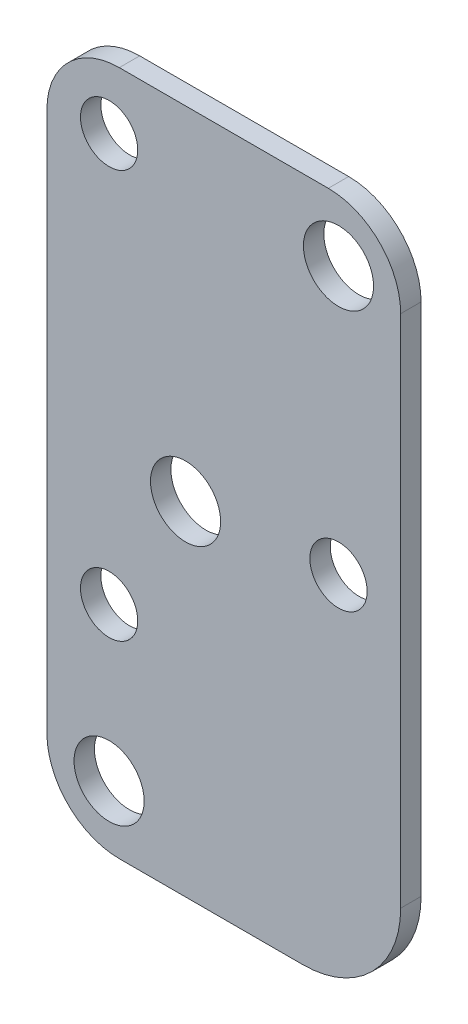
ISO-10303-21;
HEADER;
FILE_DESCRIPTION(('STEP AP214'),'2;1');
FILE_NAME('part.step','',(''),(''),'','','');
FILE_SCHEMA(('AUTOMOTIVE_DESIGN { 1 0 10303 214 1 1 1 1 }'));
ENDSEC;
DATA;
#1=APPLICATION_CONTEXT('core data for automotive mechanical design processes');
#2=APPLICATION_PROTOCOL_DEFINITION('international standard','automotive_design',2000,#1);
#3=PRODUCT_CONTEXT('',#1,'mechanical');
#4=PRODUCT('Part','Part','',(#3));
#5=PRODUCT_RELATED_PRODUCT_CATEGORY('part','',(#4));
#6=PRODUCT_DEFINITION_FORMATION('','',#4);
#7=PRODUCT_DEFINITION_CONTEXT('part definition',#1,'design');
#8=PRODUCT_DEFINITION('design','',#6,#7);
#9=PRODUCT_DEFINITION_SHAPE('','',#8);
#10=(LENGTH_UNIT() NAMED_UNIT(*) SI_UNIT(.MILLI.,.METRE.));
#11=(NAMED_UNIT(*) PLANE_ANGLE_UNIT() SI_UNIT($,.RADIAN.));
#12=(NAMED_UNIT(*) SI_UNIT($,.STERADIAN.) SOLID_ANGLE_UNIT());
#13=UNCERTAINTY_MEASURE_WITH_UNIT(LENGTH_MEASURE(1.E-05),#10,'distance_accuracy_value','');
#14=(GEOMETRIC_REPRESENTATION_CONTEXT(3) GLOBAL_UNCERTAINTY_ASSIGNED_CONTEXT((#13)) GLOBAL_UNIT_ASSIGNED_CONTEXT((#10,
#11,#12)) REPRESENTATION_CONTEXT('',''));
#15=CARTESIAN_POINT('',(0.,0.,0.));
#16=DIRECTION('',(0.,0.,1.));
#17=DIRECTION('',(1.,0.,0.));
#18=AXIS2_PLACEMENT_3D('',#15,#16,#17);
#19=CARTESIAN_POINT('',(-147.955,77.8002,84.6582));
#20=DIRECTION('',(0.,0.,-1.));
#21=DIRECTION('',(-1.,0.,0.));
#22=AXIS2_PLACEMENT_3D('',#19,#20,#21);
#23=CYLINDRICAL_SURFACE('',#22,9.01699999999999);
#24=CARTESIAN_POINT('',(-147.955,77.8002,82.1182));
#25=DIRECTION('',(0.,0.,-1.));
#26=DIRECTION('',(-1.,0.,0.));
#27=AXIS2_PLACEMENT_3D('',#24,#25,#26);
#28=CIRCLE('',#27,9.01699999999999);
#29=CARTESIAN_POINT('',(-156.972,77.8002,82.1182));
#30=VERTEX_POINT('',#29);
#31=CARTESIAN_POINT('',(-147.955,86.8172,82.1182));
#32=VERTEX_POINT('',#31);
#33=EDGE_CURVE('E151',#30,#32,#28,.T.);
#34=ORIENTED_EDGE('',*,*,#33,.F.);
#35=DIRECTION('',(0.,0.,-1.));
#36=VECTOR('',#35,1.);
#37=CARTESIAN_POINT('',(-156.972,77.8002,84.6582));
#38=LINE('',#37,#36);
#39=CARTESIAN_POINT('',(-156.972,77.8002,84.6582));
#40=VERTEX_POINT('',#39);
#41=EDGE_CURVE('E11',#40,#30,#38,.T.);
#42=ORIENTED_EDGE('',*,*,#41,.F.);
#43=CARTESIAN_POINT('',(-147.955,77.8002,84.6582));
#44=DIRECTION('',(0.,0.,-1.));
#45=DIRECTION('',(-1.,0.,0.));
#46=AXIS2_PLACEMENT_3D('',#43,#44,#45);
#47=CIRCLE('',#46,9.01699999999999);
#48=CARTESIAN_POINT('',(-147.955,86.8172,84.6582));
#49=VERTEX_POINT('',#48);
#50=EDGE_CURVE('E180',#40,#49,#47,.T.);
#51=ORIENTED_EDGE('',*,*,#50,.T.);
#52=DIRECTION('',(0.,0.,-1.));
#53=VECTOR('',#52,1.);
#54=CARTESIAN_POINT('',(-147.955,86.8172,84.6582));
#55=LINE('',#54,#53);
#56=EDGE_CURVE('E50',#49,#32,#55,.T.);
#57=ORIENTED_EDGE('',*,*,#56,.T.);
#58=EDGE_LOOP('',(#34,#42,#51,#57));
#59=FACE_BOUND('',#58,.T.);
#60=ADVANCED_FACE('F47',(#59),#23,.T.);
#61=CARTESIAN_POINT('',(-156.972,10.4902,84.6582));
#62=DIRECTION('',(-1.,0.,0.));
#63=DIRECTION('',(0.,-1.,0.));
#64=AXIS2_PLACEMENT_3D('',#61,#62,#63);
#65=PLANE('',#64);
#66=DIRECTION('',(0.,1.,0.));
#67=VECTOR('',#66,1.);
#68=CARTESIAN_POINT('',(-156.972,10.4902,82.1182));
#69=LINE('',#68,#67);
#70=CARTESIAN_POINT('',(-156.972,10.4902,82.1182));
#71=VERTEX_POINT('',#70);
#72=EDGE_CURVE('E177',#71,#30,#69,.T.);
#73=ORIENTED_EDGE('',*,*,#72,.F.);
#74=DIRECTION('',(0.,0.,-1.));
#75=VECTOR('',#74,1.);
#76=CARTESIAN_POINT('',(-156.972,10.4902,84.6582));
#77=LINE('',#76,#75);
#78=CARTESIAN_POINT('',(-156.972,10.4902,84.6582));
#79=VERTEX_POINT('',#78);
#80=EDGE_CURVE('E57',#79,#71,#77,.T.);
#81=ORIENTED_EDGE('',*,*,#80,.F.);
#82=DIRECTION('',(0.,1.,0.));
#83=VECTOR('',#82,1.);
#84=CARTESIAN_POINT('',(-156.972,10.4902,84.6582));
#85=LINE('',#84,#83);
#86=EDGE_CURVE('E136',#79,#40,#85,.T.);
#87=ORIENTED_EDGE('',*,*,#86,.T.);
#88=ORIENTED_EDGE('',*,*,#41,.T.);
#89=EDGE_LOOP('',(#73,#81,#87,#88));
#90=FACE_BOUND('',#89,.T.);
#91=ADVANCED_FACE('F200',(#90),#65,.T.);
#92=CARTESIAN_POINT('',(-147.955,10.4902,84.6582));
#93=DIRECTION('',(0.,0.,-1.));
#94=DIRECTION('',(-1.,0.,0.));
#95=AXIS2_PLACEMENT_3D('',#92,#93,#94);
#96=CYLINDRICAL_SURFACE('',#95,9.01699999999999);
#97=CARTESIAN_POINT('',(-147.955,10.4902,82.1182));
#98=DIRECTION('',(0.,0.,-1.));
#99=DIRECTION('',(-1.,0.,0.));
#100=AXIS2_PLACEMENT_3D('',#97,#98,#99);
#101=CIRCLE('',#100,9.01699999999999);
#102=CARTESIAN_POINT('',(-147.955,1.47320000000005,82.1182));
#103=VERTEX_POINT('',#102);
#104=EDGE_CURVE('E122',#103,#71,#101,.T.);
#105=ORIENTED_EDGE('',*,*,#104,.F.);
#106=DIRECTION('',(0.,0.,-1.));
#107=VECTOR('',#106,1.);
#108=CARTESIAN_POINT('',(-147.955,1.47320000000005,84.6582));
#109=LINE('',#108,#107);
#110=CARTESIAN_POINT('',(-147.955,1.47320000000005,84.6582));
#111=VERTEX_POINT('',#110);
#112=EDGE_CURVE('E117',#111,#103,#109,.T.);
#113=ORIENTED_EDGE('',*,*,#112,.F.);
#114=CARTESIAN_POINT('',(-147.955,10.4902,84.6582));
#115=DIRECTION('',(0.,0.,-1.));
#116=DIRECTION('',(-1.,0.,0.));
#117=AXIS2_PLACEMENT_3D('',#114,#115,#116);
#118=CIRCLE('',#117,9.01699999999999);
#119=EDGE_CURVE('E120',#111,#79,#118,.T.);
#120=ORIENTED_EDGE('',*,*,#119,.T.);
#121=ORIENTED_EDGE('',*,*,#80,.T.);
#122=EDGE_LOOP('',(#105,#113,#120,#121));
#123=FACE_BOUND('',#122,.T.);
#124=ADVANCED_FACE('F119',(#123),#96,.T.);
#125=CARTESIAN_POINT('',(-125.095,1.47320000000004,84.6582));
#126=DIRECTION('',(0.,-1.,0.));
#127=DIRECTION('',(1.,0.,0.));
#128=AXIS2_PLACEMENT_3D('',#125,#126,#127);
#129=PLANE('',#128);
#130=DIRECTION('',(-1.,0.,0.));
#131=VECTOR('',#130,1.);
#132=CARTESIAN_POINT('',(-125.095,1.47320000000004,82.1182));
#133=LINE('',#132,#131);
#134=CARTESIAN_POINT('',(-125.095,1.47320000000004,82.1182));
#135=VERTEX_POINT('',#134);
#136=EDGE_CURVE('E172',#135,#103,#133,.T.);
#137=ORIENTED_EDGE('',*,*,#136,.F.);
#138=DIRECTION('',(0.,0.,-1.));
#139=VECTOR('',#138,1.);
#140=CARTESIAN_POINT('',(-125.095,1.47320000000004,84.6582));
#141=LINE('',#140,#139);
#142=CARTESIAN_POINT('',(-125.095,1.47320000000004,84.6582));
#143=VERTEX_POINT('',#142);
#144=EDGE_CURVE('E128',#143,#135,#141,.T.);
#145=ORIENTED_EDGE('',*,*,#144,.F.);
#146=DIRECTION('',(-1.,0.,0.));
#147=VECTOR('',#146,1.);
#148=CARTESIAN_POINT('',(-125.095,1.47320000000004,84.6582));
#149=LINE('',#148,#147);
#150=EDGE_CURVE('E134',#143,#111,#149,.T.);
#151=ORIENTED_EDGE('',*,*,#150,.T.);
#152=ORIENTED_EDGE('',*,*,#112,.T.);
#153=EDGE_LOOP('',(#137,#145,#151,#152));
#154=FACE_BOUND('',#153,.T.);
#155=ADVANCED_FACE('F139',(#154),#129,.T.);
#156=CARTESIAN_POINT('',(-125.095,13.6652,84.6582));
#157=DIRECTION('',(0.,0.,-1.));
#158=DIRECTION('',(-1.,0.,0.));
#159=AXIS2_PLACEMENT_3D('',#156,#157,#158);
#160=CYLINDRICAL_SURFACE('',#159,12.192);
#161=CARTESIAN_POINT('',(-125.095,13.6652,82.1182));
#162=DIRECTION('',(0.,0.,-1.));
#163=DIRECTION('',(-1.,0.,0.));
#164=AXIS2_PLACEMENT_3D('',#161,#162,#163);
#165=CIRCLE('',#164,12.192);
#166=CARTESIAN_POINT('',(-112.903,13.6652,82.1182));
#167=VERTEX_POINT('',#166);
#168=EDGE_CURVE('E168',#167,#135,#165,.T.);
#169=ORIENTED_EDGE('',*,*,#168,.F.);
#170=DIRECTION('',(0.,0.,-1.));
#171=VECTOR('',#170,1.);
#172=CARTESIAN_POINT('',(-112.903,13.6652,84.6582));
#173=LINE('',#172,#171);
#174=CARTESIAN_POINT('',(-112.903,13.6652,84.6582));
#175=VERTEX_POINT('',#174);
#176=EDGE_CURVE('E186',#175,#167,#173,.T.);
#177=ORIENTED_EDGE('',*,*,#176,.F.);
#178=CARTESIAN_POINT('',(-125.095,13.6652,84.6582));
#179=DIRECTION('',(0.,0.,-1.));
#180=DIRECTION('',(-1.,0.,0.));
#181=AXIS2_PLACEMENT_3D('',#178,#179,#180);
#182=CIRCLE('',#181,12.192);
#183=EDGE_CURVE('E141',#175,#143,#182,.T.);
#184=ORIENTED_EDGE('',*,*,#183,.T.);
#185=ORIENTED_EDGE('',*,*,#144,.T.);
#186=EDGE_LOOP('',(#169,#177,#184,#185));
#187=FACE_BOUND('',#186,.T.);
#188=ADVANCED_FACE('F213',(#187),#160,.T.);
#189=CARTESIAN_POINT('',(-112.903,77.8002,84.6582));
#190=DIRECTION('',(1.,0.,0.));
#191=DIRECTION('',(0.,0.,-1.));
#192=AXIS2_PLACEMENT_3D('',#189,#190,#191);
#193=PLANE('',#192);
#194=DIRECTION('',(0.,-1.,0.));
#195=VECTOR('',#194,1.);
#196=CARTESIAN_POINT('',(-112.903,77.8002,82.1182));
#197=LINE('',#196,#195);
#198=CARTESIAN_POINT('',(-112.903,77.8002,82.1182));
#199=VERTEX_POINT('',#198);
#200=EDGE_CURVE('E164',#199,#167,#197,.T.);
#201=ORIENTED_EDGE('',*,*,#200,.F.);
#202=DIRECTION('',(0.,0.,-1.));
#203=VECTOR('',#202,1.);
#204=CARTESIAN_POINT('',(-112.903,77.8002,84.6582));
#205=LINE('',#204,#203);
#206=CARTESIAN_POINT('',(-112.903,77.8002,84.6582));
#207=VERTEX_POINT('',#206);
#208=EDGE_CURVE('E189',#207,#199,#205,.T.);
#209=ORIENTED_EDGE('',*,*,#208,.F.);
#210=DIRECTION('',(0.,-1.,0.));
#211=VECTOR('',#210,1.);
#212=CARTESIAN_POINT('',(-112.903,77.8002,84.6582));
#213=LINE('',#212,#211);
#214=EDGE_CURVE('E145',#207,#175,#213,.T.);
#215=ORIENTED_EDGE('',*,*,#214,.T.);
#216=ORIENTED_EDGE('',*,*,#176,.T.);
#217=EDGE_LOOP('',(#201,#209,#215,#216));
#218=FACE_BOUND('',#217,.T.);
#219=ADVANCED_FACE('F216',(#218),#193,.T.);
#220=CARTESIAN_POINT('',(-121.92,77.8002,84.6582));
#221=DIRECTION('',(0.,0.,-1.));
#222=DIRECTION('',(-1.,0.,0.));
#223=AXIS2_PLACEMENT_3D('',#220,#221,#222);
#224=CYLINDRICAL_SURFACE('',#223,9.017);
#225=CARTESIAN_POINT('',(-121.92,77.8002,82.1182));
#226=DIRECTION('',(0.,0.,-1.));
#227=DIRECTION('',(-1.,0.,0.));
#228=AXIS2_PLACEMENT_3D('',#225,#226,#227);
#229=CIRCLE('',#228,9.017);
#230=CARTESIAN_POINT('',(-121.92,86.8172,82.1182));
#231=VERTEX_POINT('',#230);
#232=EDGE_CURVE('E160',#231,#199,#229,.T.);
#233=ORIENTED_EDGE('',*,*,#232,.F.);
#234=DIRECTION('',(0.,0.,-1.));
#235=VECTOR('',#234,1.);
#236=CARTESIAN_POINT('',(-121.92,86.8172,84.6582));
#237=LINE('',#236,#235);
#238=CARTESIAN_POINT('',(-121.92,86.8172,84.6582));
#239=VERTEX_POINT('',#238);
#240=EDGE_CURVE('E191',#239,#231,#237,.T.);
#241=ORIENTED_EDGE('',*,*,#240,.F.);
#242=CARTESIAN_POINT('',(-121.92,77.8002,84.6582));
#243=DIRECTION('',(0.,0.,-1.));
#244=DIRECTION('',(-1.,0.,0.));
#245=AXIS2_PLACEMENT_3D('',#242,#243,#244);
#246=CIRCLE('',#245,9.017);
#247=EDGE_CURVE('E319',#239,#207,#246,.T.);
#248=ORIENTED_EDGE('',*,*,#247,.T.);
#249=ORIENTED_EDGE('',*,*,#208,.T.);
#250=EDGE_LOOP('',(#233,#241,#248,#249));
#251=FACE_BOUND('',#250,.T.);
#252=ADVANCED_FACE('F220',(#251),#224,.T.);
#253=CARTESIAN_POINT('',(-147.955,86.8172,84.6582));
#254=DIRECTION('',(0.,1.,0.));
#255=DIRECTION('',(-1.,0.,0.));
#256=AXIS2_PLACEMENT_3D('',#253,#254,#255);
#257=PLANE('',#256);
#258=DIRECTION('',(1.,0.,0.));
#259=VECTOR('',#258,1.);
#260=CARTESIAN_POINT('',(-147.955,86.8172,82.1182));
#261=LINE('',#260,#259);
#262=EDGE_CURVE('E155',#32,#231,#261,.T.);
#263=ORIENTED_EDGE('',*,*,#262,.F.);
#264=ORIENTED_EDGE('',*,*,#56,.F.);
#265=DIRECTION('',(1.,0.,0.));
#266=VECTOR('',#265,1.);
#267=CARTESIAN_POINT('',(-147.955,86.8172,84.6582));
#268=LINE('',#267,#266);
#269=EDGE_CURVE('E316',#49,#239,#268,.T.);
#270=ORIENTED_EDGE('',*,*,#269,.T.);
#271=ORIENTED_EDGE('',*,*,#240,.T.);
#272=EDGE_LOOP('',(#263,#264,#270,#271));
#273=FACE_BOUND('',#272,.T.);
#274=ADVANCED_FACE('F197',(#273),#257,.T.);
#275=CARTESIAN_POINT('',(-147.955,77.8002,84.6582));
#276=DIRECTION('',(0.,0.,-1.));
#277=DIRECTION('',(-1.,0.,0.));
#278=AXIS2_PLACEMENT_3D('',#275,#276,#277);
#279=PLANE('',#278);
#280=CARTESIAN_POINT('',(-120.65,79.0702,84.6582));
#281=DIRECTION('',(0.,0.,-1.));
#282=DIRECTION('',(-1.,0.,0.));
#283=AXIS2_PLACEMENT_3D('',#280,#281,#282);
#284=CIRCLE('',#283,4.36879999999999);
#285=CARTESIAN_POINT('',(-125.0188,79.0702,84.6582));
#286=VERTEX_POINT('',#285);
#287=EDGE_CURVE('E265',#286,#286,#284,.T.);
#288=ORIENTED_EDGE('',*,*,#287,.T.);
#289=EDGE_LOOP('',(#288));
#290=FACE_BOUND('',#289,.T.);
#291=CARTESIAN_POINT('',(-139.7,44.1452000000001,84.6582));
#292=DIRECTION('',(0.,0.,-1.));
#293=DIRECTION('',(-1.,0.,0.));
#294=AXIS2_PLACEMENT_3D('',#291,#292,#293);
#295=CIRCLE('',#294,4.36880000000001);
#296=CARTESIAN_POINT('',(-144.0688,44.1452000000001,84.6582));
#297=VERTEX_POINT('',#296);
#298=EDGE_CURVE('E279',#297,#297,#295,.T.);
#299=ORIENTED_EDGE('',*,*,#298,.T.);
#300=EDGE_LOOP('',(#299));
#301=FACE_BOUND('',#300,.T.);
#302=CARTESIAN_POINT('',(-149.225,9.22020000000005,84.6582));
#303=DIRECTION('',(0.,0.,-1.));
#304=DIRECTION('',(-1.,0.,0.));
#305=AXIS2_PLACEMENT_3D('',#302,#303,#304);
#306=CIRCLE('',#305,4.36880000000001);
#307=CARTESIAN_POINT('',(-153.5938,9.22020000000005,84.6582));
#308=VERTEX_POINT('',#307);
#309=EDGE_CURVE('E287',#308,#308,#306,.T.);
#310=ORIENTED_EDGE('',*,*,#309,.T.);
#311=EDGE_LOOP('',(#310));
#312=FACE_BOUND('',#311,.T.);
#313=CARTESIAN_POINT('',(-149.225,28.2702000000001,84.6582));
#314=DIRECTION('',(0.,0.,1.));
#315=DIRECTION('',(1.,0.,0.));
#316=AXIS2_PLACEMENT_3D('',#313,#314,#315);
#317=CIRCLE('',#316,3.56870000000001);
#318=CARTESIAN_POINT('',(-145.6563,28.2702000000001,84.6582));
#319=VERTEX_POINT('',#318);
#320=EDGE_CURVE('E295',#319,#319,#317,.T.);
#321=ORIENTED_EDGE('',*,*,#320,.F.);
#322=EDGE_LOOP('',(#321));
#323=FACE_BOUND('',#322,.T.);
#324=CARTESIAN_POINT('',(-120.65,45.7327,84.6582));
#325=DIRECTION('',(0.,0.,1.));
#326=DIRECTION('',(1.,0.,0.));
#327=AXIS2_PLACEMENT_3D('',#324,#325,#326);
#328=CIRCLE('',#327,3.56869999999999);
#329=CARTESIAN_POINT('',(-117.0813,45.7327,84.6582));
#330=VERTEX_POINT('',#329);
#331=EDGE_CURVE('E303',#330,#330,#328,.T.);
#332=ORIENTED_EDGE('',*,*,#331,.F.);
#333=EDGE_LOOP('',(#332));
#334=FACE_BOUND('',#333,.T.);
#335=CARTESIAN_POINT('',(-149.225,79.0702,84.6582));
#336=DIRECTION('',(0.,0.,1.));
#337=DIRECTION('',(1.,0.,0.));
#338=AXIS2_PLACEMENT_3D('',#335,#336,#337);
#339=CIRCLE('',#338,3.56870000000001);
#340=CARTESIAN_POINT('',(-145.6563,79.0702,84.6582));
#341=VERTEX_POINT('',#340);
#342=EDGE_CURVE('E156',#341,#341,#339,.T.);
#343=ORIENTED_EDGE('',*,*,#342,.F.);
#344=EDGE_LOOP('',(#343));
#345=FACE_BOUND('',#344,.T.);
#346=ORIENTED_EDGE('',*,*,#50,.F.);
#347=ORIENTED_EDGE('',*,*,#86,.F.);
#348=ORIENTED_EDGE('',*,*,#119,.F.);
#349=ORIENTED_EDGE('',*,*,#150,.F.);
#350=ORIENTED_EDGE('',*,*,#183,.F.);
#351=ORIENTED_EDGE('',*,*,#214,.F.);
#352=ORIENTED_EDGE('',*,*,#247,.F.);
#353=ORIENTED_EDGE('',*,*,#269,.F.);
#354=EDGE_LOOP('',(#346,#347,#348,#349,#350,#351,#352,#353));
#355=FACE_BOUND('',#354,.T.);
#356=ADVANCED_FACE('F132',(#290,#301,#312,#323,#334,#345,#355),#279,.F.);
#357=CARTESIAN_POINT('',(-147.955,77.8002,82.1182));
#358=DIRECTION('',(0.,0.,-1.));
#359=DIRECTION('',(-1.,0.,0.));
#360=AXIS2_PLACEMENT_3D('',#357,#358,#359);
#361=PLANE('',#360);
#362=CARTESIAN_POINT('',(-120.65,79.0702,82.1182));
#363=DIRECTION('',(0.,0.,-1.));
#364=DIRECTION('',(-1.,0.,0.));
#365=AXIS2_PLACEMENT_3D('',#362,#363,#364);
#366=CIRCLE('',#365,4.36879999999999);
#367=CARTESIAN_POINT('',(-125.0188,79.0702,82.1182));
#368=VERTEX_POINT('',#367);
#369=EDGE_CURVE('E268',#368,#368,#366,.T.);
#370=ORIENTED_EDGE('',*,*,#369,.F.);
#371=EDGE_LOOP('',(#370));
#372=FACE_BOUND('',#371,.T.);
#373=CARTESIAN_POINT('',(-139.7,44.1452000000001,82.1182));
#374=DIRECTION('',(0.,0.,-1.));
#375=DIRECTION('',(-1.,0.,0.));
#376=AXIS2_PLACEMENT_3D('',#373,#374,#375);
#377=CIRCLE('',#376,4.36880000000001);
#378=CARTESIAN_POINT('',(-144.0688,44.1452000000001,82.1182));
#379=VERTEX_POINT('',#378);
#380=EDGE_CURVE('E273',#379,#379,#377,.T.);
#381=ORIENTED_EDGE('',*,*,#380,.F.);
#382=EDGE_LOOP('',(#381));
#383=FACE_BOUND('',#382,.T.);
#384=CARTESIAN_POINT('',(-149.225,9.22020000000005,82.1182));
#385=DIRECTION('',(0.,0.,-1.));
#386=DIRECTION('',(-1.,0.,0.));
#387=AXIS2_PLACEMENT_3D('',#384,#385,#386);
#388=CIRCLE('',#387,4.36880000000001);
#389=CARTESIAN_POINT('',(-153.5938,9.22020000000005,82.1182));
#390=VERTEX_POINT('',#389);
#391=EDGE_CURVE('E283',#390,#390,#388,.T.);
#392=ORIENTED_EDGE('',*,*,#391,.F.);
#393=EDGE_LOOP('',(#392));
#394=FACE_BOUND('',#393,.T.);
#395=CARTESIAN_POINT('',(-149.225,28.2702000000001,82.1182));
#396=DIRECTION('',(0.,0.,1.));
#397=DIRECTION('',(1.,0.,0.));
#398=AXIS2_PLACEMENT_3D('',#395,#396,#397);
#399=CIRCLE('',#398,3.56870000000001);
#400=CARTESIAN_POINT('',(-145.6563,28.2702000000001,82.1182));
#401=VERTEX_POINT('',#400);
#402=EDGE_CURVE('E291',#401,#401,#399,.T.);
#403=ORIENTED_EDGE('',*,*,#402,.T.);
#404=EDGE_LOOP('',(#403));
#405=FACE_BOUND('',#404,.T.);
#406=CARTESIAN_POINT('',(-120.65,45.7327,82.1182));
#407=DIRECTION('',(0.,0.,1.));
#408=DIRECTION('',(1.,0.,0.));
#409=AXIS2_PLACEMENT_3D('',#406,#407,#408);
#410=CIRCLE('',#409,3.56869999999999);
#411=CARTESIAN_POINT('',(-117.0813,45.7327,82.1182));
#412=VERTEX_POINT('',#411);
#413=EDGE_CURVE('E299',#412,#412,#410,.T.);
#414=ORIENTED_EDGE('',*,*,#413,.T.);
#415=EDGE_LOOP('',(#414));
#416=FACE_BOUND('',#415,.T.);
#417=CARTESIAN_POINT('',(-149.225,79.0702,82.1182));
#418=DIRECTION('',(0.,0.,1.));
#419=DIRECTION('',(1.,0.,0.));
#420=AXIS2_PLACEMENT_3D('',#417,#418,#419);
#421=CIRCLE('',#420,3.56870000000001);
#422=CARTESIAN_POINT('',(-145.6563,79.0702,82.1182));
#423=VERTEX_POINT('',#422);
#424=EDGE_CURVE('E307',#423,#423,#421,.T.);
#425=ORIENTED_EDGE('',*,*,#424,.T.);
#426=EDGE_LOOP('',(#425));
#427=FACE_BOUND('',#426,.T.);
#428=ORIENTED_EDGE('',*,*,#33,.T.);
#429=ORIENTED_EDGE('',*,*,#262,.T.);
#430=ORIENTED_EDGE('',*,*,#232,.T.);
#431=ORIENTED_EDGE('',*,*,#200,.T.);
#432=ORIENTED_EDGE('',*,*,#168,.T.);
#433=ORIENTED_EDGE('',*,*,#136,.T.);
#434=ORIENTED_EDGE('',*,*,#104,.T.);
#435=ORIENTED_EDGE('',*,*,#72,.T.);
#436=EDGE_LOOP('',(#428,#429,#430,#431,#432,#433,#434,#435));
#437=FACE_BOUND('',#436,.T.);
#438=ADVANCED_FACE('F199',(#372,#383,#394,#405,#416,#427,#437),#361,.T.);
#439=CARTESIAN_POINT('',(-149.225,79.0702,84.6582));
#440=DIRECTION('',(0.,0.,1.));
#441=DIRECTION('',(1.,0.,0.));
#442=AXIS2_PLACEMENT_3D('',#439,#440,#441);
#443=CYLINDRICAL_SURFACE('',#442,3.56870000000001);
#444=ORIENTED_EDGE('',*,*,#424,.F.);
#445=EDGE_LOOP('',(#444));
#446=FACE_BOUND('',#445,.T.);
#447=ORIENTED_EDGE('',*,*,#342,.T.);
#448=EDGE_LOOP('',(#447));
#449=FACE_BOUND('',#448,.T.);
#450=ADVANCED_FACE('F234',(#446,#449),#443,.F.);
#451=CARTESIAN_POINT('',(-120.65,45.7327,84.6582));
#452=DIRECTION('',(0.,0.,1.));
#453=DIRECTION('',(1.,0.,0.));
#454=AXIS2_PLACEMENT_3D('',#451,#452,#453);
#455=CYLINDRICAL_SURFACE('',#454,3.56869999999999);
#456=ORIENTED_EDGE('',*,*,#413,.F.);
#457=EDGE_LOOP('',(#456));
#458=FACE_BOUND('',#457,.T.);
#459=ORIENTED_EDGE('',*,*,#331,.T.);
#460=EDGE_LOOP('',(#459));
#461=FACE_BOUND('',#460,.T.);
#462=ADVANCED_FACE('F241',(#458,#461),#455,.F.);
#463=CARTESIAN_POINT('',(-149.225,28.2702000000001,84.6582));
#464=DIRECTION('',(0.,0.,1.));
#465=DIRECTION('',(1.,0.,0.));
#466=AXIS2_PLACEMENT_3D('',#463,#464,#465);
#467=CYLINDRICAL_SURFACE('',#466,3.56870000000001);
#468=ORIENTED_EDGE('',*,*,#402,.F.);
#469=EDGE_LOOP('',(#468));
#470=FACE_BOUND('',#469,.T.);
#471=ORIENTED_EDGE('',*,*,#320,.T.);
#472=EDGE_LOOP('',(#471));
#473=FACE_BOUND('',#472,.T.);
#474=ADVANCED_FACE('F245',(#470,#473),#467,.F.);
#475=CARTESIAN_POINT('',(-149.225,9.22020000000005,82.1182));
#476=DIRECTION('',(0.,0.,-1.));
#477=DIRECTION('',(-1.,0.,0.));
#478=AXIS2_PLACEMENT_3D('',#475,#476,#477);
#479=CYLINDRICAL_SURFACE('',#478,4.36880000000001);
#480=ORIENTED_EDGE('',*,*,#309,.F.);
#481=EDGE_LOOP('',(#480));
#482=FACE_BOUND('',#481,.T.);
#483=ORIENTED_EDGE('',*,*,#391,.T.);
#484=EDGE_LOOP('',(#483));
#485=FACE_BOUND('',#484,.T.);
#486=ADVANCED_FACE('F249',(#482,#485),#479,.F.);
#487=CARTESIAN_POINT('',(-139.7,44.1452000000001,82.1182));
#488=DIRECTION('',(0.,0.,-1.));
#489=DIRECTION('',(-1.,0.,0.));
#490=AXIS2_PLACEMENT_3D('',#487,#488,#489);
#491=CYLINDRICAL_SURFACE('',#490,4.36880000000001);
#492=ORIENTED_EDGE('',*,*,#298,.F.);
#493=EDGE_LOOP('',(#492));
#494=FACE_BOUND('',#493,.T.);
#495=ORIENTED_EDGE('',*,*,#380,.T.);
#496=EDGE_LOOP('',(#495));
#497=FACE_BOUND('',#496,.T.);
#498=ADVANCED_FACE('F253',(#494,#497),#491,.F.);
#499=CARTESIAN_POINT('',(-120.65,79.0702,82.1182));
#500=DIRECTION('',(0.,0.,-1.));
#501=DIRECTION('',(-1.,0.,0.));
#502=AXIS2_PLACEMENT_3D('',#499,#500,#501);
#503=CYLINDRICAL_SURFACE('',#502,4.36879999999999);
#504=ORIENTED_EDGE('',*,*,#287,.F.);
#505=EDGE_LOOP('',(#504));
#506=FACE_BOUND('',#505,.T.);
#507=ORIENTED_EDGE('',*,*,#369,.T.);
#508=EDGE_LOOP('',(#507));
#509=FACE_BOUND('',#508,.T.);
#510=ADVANCED_FACE('F257',(#506,#509),#503,.F.);
#511=CLOSED_SHELL('',(#60,#91,#124,#155,#188,#219,#252,#274,#356,#438,#450,#462,#474,#486,#498,#510));
#512=MANIFOLD_SOLID_BREP('B2',#511);
#513=ADVANCED_BREP_SHAPE_REPRESENTATION('',(#18,#512),#14);
#514=SHAPE_DEFINITION_REPRESENTATION(#9,#513);
ENDSEC;
END-ISO-10303-21;
